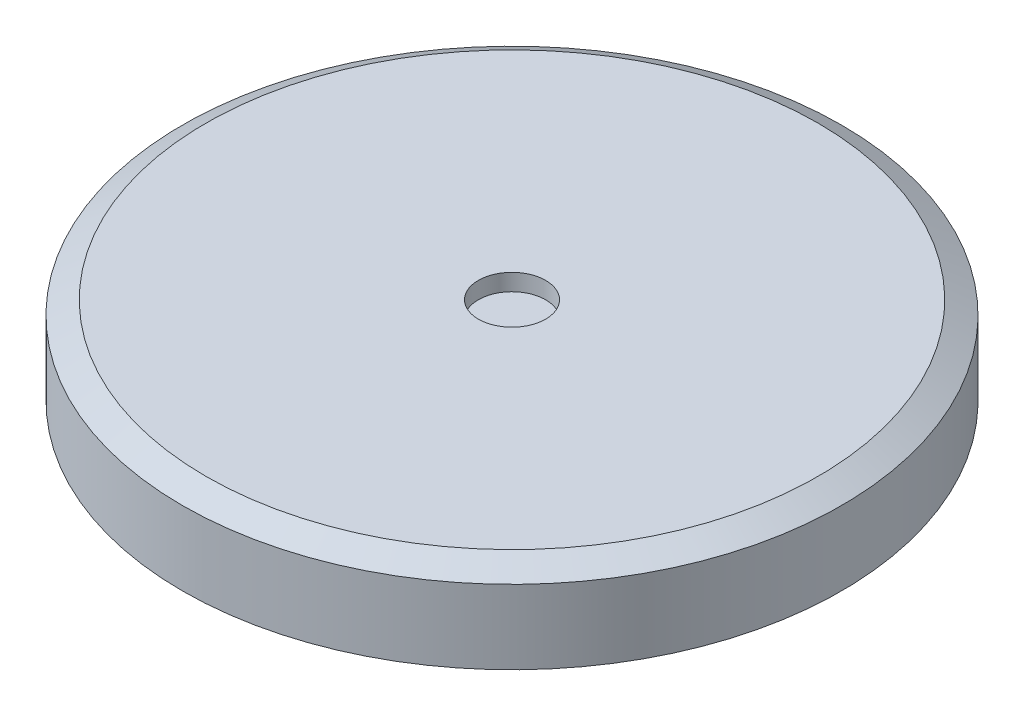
from build123d import *

# Parameters (mm, degrees)
ESQUISSE1_R             = 9.8
EXTRUSION1_DEPTH        = 3
ESQUISSE2_R             = 1
ENL_V_MAT_EXTRU_1_DEPTH = 0.5
CHANFREIN2_SIZE         = 0.4
CHANFREIN2_SIZE2        = 0.7
CHANFREIN3_SIZE         = 0.7
CHANFREIN3_SIZE2        = 0.4


with BuildPart() as part:
    # Esquisse1 → Extrusion1 (new body)
    with BuildSketch(Plane(origin=(0, 0, 0), x_dir=(1, 0, 0), z_dir=(0, 1, 0))):
        with Locations(Location((0, 0, 0), (0, 0, 270))):
            Circle(ESQUISSE1_R)
    extrude(amount=EXTRUSION1_DEPTH)

    # Esquisse2 → Enl_v. mat.-Extru.1 (cut)
    with BuildSketch(Plane(origin=(0, 3, 0), x_dir=(-1, 0, 0), z_dir=(0, 1, 0))):
        with Locations(Location((0, 0, 0), (0, 0, 90))):
            Circle(ESQUISSE2_R)
    extrude(amount=-ENL_V_MAT_EXTRU_1_DEPTH, mode=Mode.SUBTRACT)

    # Chanfrein2
    chanfrein2_edges = [part.edges().sort_by_distance(p)[0] for p in [
        (0, 3, -9.8),
    ]]
    chanfrein2_side = [part.faces().sort_by_distance(p)[0] for p in [
        (0, 1.5, -9.8),
    ]]
    chamfer(chanfrein2_edges, length=CHANFREIN2_SIZE, length2=CHANFREIN2_SIZE2, reference=chanfrein2_side[0])

    # Chanfrein3
    chanfrein3_edges = [part.edges().sort_by_distance(p)[0] for p in [
        (0, 0, -9.8),
    ]]
    chanfrein3_side = [part.faces().sort_by_distance(p)[0] for p in [
        (0, 0, 0),
    ]]
    chamfer(chanfrein3_edges, length=CHANFREIN3_SIZE, length2=CHANFREIN3_SIZE2, reference=chanfrein3_side[0])


solid = part.part
